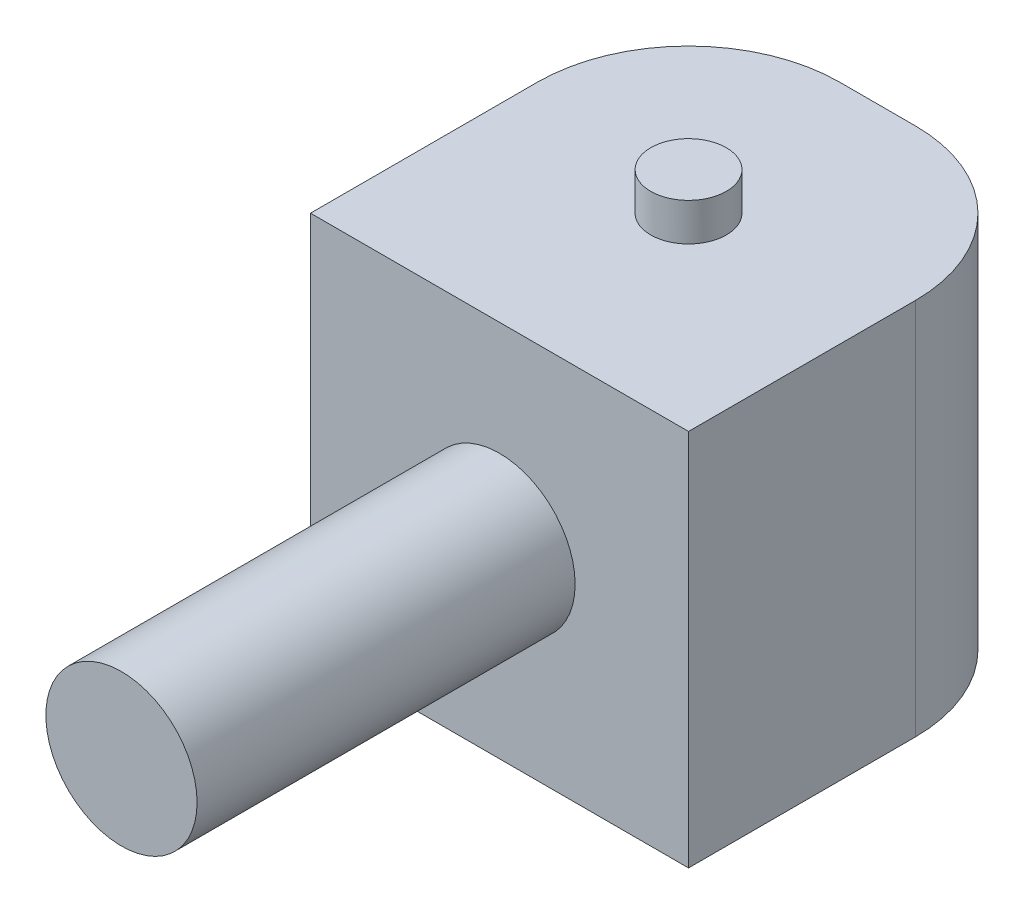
ISO-10303-21;
HEADER;
FILE_DESCRIPTION(('STEP AP214'),'2;1');
FILE_NAME('part.step','',(''),(''),'','','');
FILE_SCHEMA(('AUTOMOTIVE_DESIGN { 1 0 10303 214 1 1 1 1 }'));
ENDSEC;
DATA;
#1=APPLICATION_CONTEXT('core data for automotive mechanical design processes');
#2=APPLICATION_PROTOCOL_DEFINITION('international standard','automotive_design',2000,#1);
#3=PRODUCT_CONTEXT('',#1,'mechanical');
#4=PRODUCT('Part','Part','',(#3));
#5=PRODUCT_RELATED_PRODUCT_CATEGORY('part','',(#4));
#6=PRODUCT_DEFINITION_FORMATION('','',#4);
#7=PRODUCT_DEFINITION_CONTEXT('part definition',#1,'design');
#8=PRODUCT_DEFINITION('design','',#6,#7);
#9=PRODUCT_DEFINITION_SHAPE('','',#8);
#10=(LENGTH_UNIT() NAMED_UNIT(*) SI_UNIT(.MILLI.,.METRE.));
#11=(NAMED_UNIT(*) PLANE_ANGLE_UNIT() SI_UNIT($,.RADIAN.));
#12=(NAMED_UNIT(*) SI_UNIT($,.STERADIAN.) SOLID_ANGLE_UNIT());
#13=UNCERTAINTY_MEASURE_WITH_UNIT(LENGTH_MEASURE(1.E-05),#10,'distance_accuracy_value','');
#14=(GEOMETRIC_REPRESENTATION_CONTEXT(3) GLOBAL_UNCERTAINTY_ASSIGNED_CONTEXT((#13)) GLOBAL_UNIT_ASSIGNED_CONTEXT((#10,
#11,#12)) REPRESENTATION_CONTEXT('',''));
#15=CARTESIAN_POINT('',(0.,0.,0.));
#16=DIRECTION('',(0.,0.,1.));
#17=DIRECTION('',(1.,0.,0.));
#18=AXIS2_PLACEMENT_3D('',#15,#16,#17);
#19=CARTESIAN_POINT('',(1.27,-1.27,-2.54));
#20=DIRECTION('',(0.,-1.,0.));
#21=DIRECTION('',(0.,0.,-1.));
#22=AXIS2_PLACEMENT_3D('',#19,#20,#21);
#23=PLANE('',#22);
#24=DIRECTION('',(1.,0.,0.));
#25=VECTOR('',#24,1.);
#26=CARTESIAN_POINT('',(1.27,-1.27,-2.54));
#27=LINE('',#26,#25);
#28=CARTESIAN_POINT('',(-0.254,-1.27,-2.54));
#29=VERTEX_POINT('',#28);
#30=CARTESIAN_POINT('',(0.254,-1.27,-2.54));
#31=VERTEX_POINT('',#30);
#32=EDGE_CURVE('E100',#29,#31,#27,.T.);
#33=ORIENTED_EDGE('',*,*,#32,.T.);
#34=CARTESIAN_POINT('',(0.254,-1.27,-1.524));
#35=DIRECTION('',(0.,-1.,0.));
#36=DIRECTION('',(0.,0.,-1.));
#37=AXIS2_PLACEMENT_3D('',#34,#35,#36);
#38=CIRCLE('',#37,1.016);
#39=CARTESIAN_POINT('',(1.27,-1.27,-1.524));
#40=VERTEX_POINT('',#39);
#41=EDGE_CURVE('E41',#31,#40,#38,.T.);
#42=ORIENTED_EDGE('',*,*,#41,.T.);
#43=DIRECTION('',(0.,0.,1.));
#44=VECTOR('',#43,1.);
#45=CARTESIAN_POINT('',(1.27,-1.27,-2.54));
#46=LINE('',#45,#44);
#47=CARTESIAN_POINT('',(1.27,-1.27,0.));
#48=VERTEX_POINT('',#47);
#49=EDGE_CURVE('E126',#40,#48,#46,.T.);
#50=ORIENTED_EDGE('',*,*,#49,.T.);
#51=DIRECTION('',(1.,0.,0.));
#52=VECTOR('',#51,1.);
#53=CARTESIAN_POINT('',(1.27,-1.27,0.));
#54=LINE('',#53,#52);
#55=CARTESIAN_POINT('',(-1.27,-1.27,0.));
#56=VERTEX_POINT('',#55);
#57=EDGE_CURVE('E114',#56,#48,#54,.T.);
#58=ORIENTED_EDGE('',*,*,#57,.F.);
#59=DIRECTION('',(0.,0.,1.));
#60=VECTOR('',#59,1.);
#61=CARTESIAN_POINT('',(-1.27,-1.27,-2.54));
#62=LINE('',#61,#60);
#63=CARTESIAN_POINT('',(-1.27,-1.27,-1.524));
#64=VERTEX_POINT('',#63);
#65=EDGE_CURVE('E129',#64,#56,#62,.T.);
#66=ORIENTED_EDGE('',*,*,#65,.F.);
#67=CARTESIAN_POINT('',(-0.254,-1.27,-1.524));
#68=DIRECTION('',(0.,-1.,0.));
#69=DIRECTION('',(0.,0.,-1.));
#70=AXIS2_PLACEMENT_3D('',#67,#68,#69);
#71=CIRCLE('',#70,1.016);
#72=EDGE_CURVE('E48',#64,#29,#71,.T.);
#73=ORIENTED_EDGE('',*,*,#72,.T.);
#74=EDGE_LOOP('',(#33,#42,#50,#58,#66,#73));
#75=FACE_BOUND('',#74,.T.);
#76=CARTESIAN_POINT('',(0.,-1.27,-1.27));
#77=DIRECTION('',(0.,-1.,0.));
#78=DIRECTION('',(0.,0.,-1.));
#79=AXIS2_PLACEMENT_3D('',#76,#77,#78);
#80=CIRCLE('',#79,0.254);
#81=CARTESIAN_POINT('',(0.,-1.27,-1.524));
#82=VERTEX_POINT('',#81);
#83=EDGE_CURVE('E154',#82,#82,#80,.T.);
#84=ORIENTED_EDGE('',*,*,#83,.F.);
#85=EDGE_LOOP('',(#84));
#86=FACE_BOUND('',#85,.T.);
#87=ADVANCED_FACE('F33',(#75,#86),#23,.T.);
#88=CARTESIAN_POINT('',(0.,0.,0.));
#89=DIRECTION('',(0.,0.,1.));
#90=DIRECTION('',(1.,0.,0.));
#91=AXIS2_PLACEMENT_3D('',#88,#89,#90);
#92=PLANE('',#91);
#93=DIRECTION('',(0.,1.,0.));
#94=VECTOR('',#93,1.);
#95=CARTESIAN_POINT('',(1.27,-1.27,0.));
#96=LINE('',#95,#94);
#97=CARTESIAN_POINT('',(1.27,1.27,0.));
#98=VERTEX_POINT('',#97);
#99=EDGE_CURVE('E94',#48,#98,#96,.T.);
#100=ORIENTED_EDGE('',*,*,#99,.T.);
#101=DIRECTION('',(-1.,0.,0.));
#102=VECTOR('',#101,1.);
#103=CARTESIAN_POINT('',(1.27,1.27,0.));
#104=LINE('',#103,#102);
#105=CARTESIAN_POINT('',(-1.27,1.27,0.));
#106=VERTEX_POINT('',#105);
#107=EDGE_CURVE('E103',#98,#106,#104,.T.);
#108=ORIENTED_EDGE('',*,*,#107,.T.);
#109=DIRECTION('',(0.,-1.,0.));
#110=VECTOR('',#109,1.);
#111=CARTESIAN_POINT('',(-1.27,-1.27,0.));
#112=LINE('',#111,#110);
#113=EDGE_CURVE('E109',#106,#56,#112,.T.);
#114=ORIENTED_EDGE('',*,*,#113,.T.);
#115=ORIENTED_EDGE('',*,*,#57,.T.);
#116=EDGE_LOOP('',(#100,#108,#114,#115));
#117=FACE_BOUND('',#116,.T.);
#118=CARTESIAN_POINT('',(0.,0.,0.));
#119=DIRECTION('',(0.,0.,1.));
#120=DIRECTION('',(1.,0.,0.));
#121=AXIS2_PLACEMENT_3D('',#118,#119,#120);
#122=CIRCLE('',#121,0.508);
#123=CARTESIAN_POINT('',(0.508,0.,0.));
#124=VERTEX_POINT('',#123);
#125=EDGE_CURVE('E118',#124,#124,#122,.T.);
#126=ORIENTED_EDGE('',*,*,#125,.F.);
#127=EDGE_LOOP('',(#126));
#128=FACE_BOUND('',#127,.T.);
#129=ADVANCED_FACE('F111',(#117,#128),#92,.T.);
#130=CARTESIAN_POINT('',(1.27,-1.27,-2.54));
#131=DIRECTION('',(1.,0.,0.));
#132=DIRECTION('',(0.,0.,-1.));
#133=AXIS2_PLACEMENT_3D('',#130,#131,#132);
#134=PLANE('',#133);
#135=ORIENTED_EDGE('',*,*,#49,.F.);
#136=DIRECTION('',(0.,1.,0.));
#137=VECTOR('',#136,1.);
#138=CARTESIAN_POINT('',(1.27,1.27,-1.524));
#139=LINE('',#138,#137);
#140=CARTESIAN_POINT('',(1.27,1.27,-1.524));
#141=VERTEX_POINT('',#140);
#142=EDGE_CURVE('E97',#40,#141,#139,.T.);
#143=ORIENTED_EDGE('',*,*,#142,.T.);
#144=DIRECTION('',(0.,0.,1.));
#145=VECTOR('',#144,1.);
#146=CARTESIAN_POINT('',(1.27,1.27,-2.54));
#147=LINE('',#146,#145);
#148=EDGE_CURVE('E89',#141,#98,#147,.T.);
#149=ORIENTED_EDGE('',*,*,#148,.T.);
#150=ORIENTED_EDGE('',*,*,#99,.F.);
#151=EDGE_LOOP('',(#135,#143,#149,#150));
#152=FACE_BOUND('',#151,.T.);
#153=ADVANCED_FACE('F92',(#152),#134,.T.);
#154=CARTESIAN_POINT('',(-1.27,-1.27,-2.54));
#155=DIRECTION('',(-1.,0.,0.));
#156=DIRECTION('',(0.,0.,1.));
#157=AXIS2_PLACEMENT_3D('',#154,#155,#156);
#158=PLANE('',#157);
#159=DIRECTION('',(0.,0.,1.));
#160=VECTOR('',#159,1.);
#161=CARTESIAN_POINT('',(-1.27,1.27,-2.54));
#162=LINE('',#161,#160);
#163=CARTESIAN_POINT('',(-1.27,1.27,-1.524));
#164=VERTEX_POINT('',#163);
#165=EDGE_CURVE('E99',#164,#106,#162,.T.);
#166=ORIENTED_EDGE('',*,*,#165,.F.);
#167=DIRECTION('',(0.,-1.,0.));
#168=VECTOR('',#167,1.);
#169=CARTESIAN_POINT('',(-1.27,-1.27,-1.524));
#170=LINE('',#169,#168);
#171=EDGE_CURVE('E11',#164,#64,#170,.T.);
#172=ORIENTED_EDGE('',*,*,#171,.T.);
#173=ORIENTED_EDGE('',*,*,#65,.T.);
#174=ORIENTED_EDGE('',*,*,#113,.F.);
#175=EDGE_LOOP('',(#166,#172,#173,#174));
#176=FACE_BOUND('',#175,.T.);
#177=ADVANCED_FACE('F187',(#176),#158,.T.);
#178=CARTESIAN_POINT('',(1.27,1.27,-2.54));
#179=DIRECTION('',(0.,1.,0.));
#180=DIRECTION('',(0.,0.,1.));
#181=AXIS2_PLACEMENT_3D('',#178,#179,#180);
#182=PLANE('',#181);
#183=CARTESIAN_POINT('',(0.,1.27,-1.27));
#184=DIRECTION('',(0.,1.,0.));
#185=DIRECTION('',(0.,0.,1.));
#186=AXIS2_PLACEMENT_3D('',#183,#184,#185);
#187=CIRCLE('',#186,0.254);
#188=CARTESIAN_POINT('',(0.,1.27,-1.016));
#189=VERTEX_POINT('',#188);
#190=EDGE_CURVE('E128',#189,#189,#187,.T.);
#191=ORIENTED_EDGE('',*,*,#190,.F.);
#192=EDGE_LOOP('',(#191));
#193=FACE_BOUND('',#192,.T.);
#194=ORIENTED_EDGE('',*,*,#148,.F.);
#195=CARTESIAN_POINT('',(0.254,1.27,-1.524));
#196=DIRECTION('',(0.,1.,0.));
#197=DIRECTION('',(0.,0.,1.));
#198=AXIS2_PLACEMENT_3D('',#195,#196,#197);
#199=CIRCLE('',#198,1.016);
#200=CARTESIAN_POINT('',(0.254,1.27,-2.54));
#201=VERTEX_POINT('',#200);
#202=EDGE_CURVE('E137',#141,#201,#199,.T.);
#203=ORIENTED_EDGE('',*,*,#202,.T.);
#204=DIRECTION('',(-1.,0.,0.));
#205=VECTOR('',#204,1.);
#206=CARTESIAN_POINT('',(1.27,1.27,-2.54));
#207=LINE('',#206,#205);
#208=CARTESIAN_POINT('',(-0.254,1.27,-2.54));
#209=VERTEX_POINT('',#208);
#210=EDGE_CURVE('E125',#201,#209,#207,.T.);
#211=ORIENTED_EDGE('',*,*,#210,.T.);
#212=CARTESIAN_POINT('',(-0.254,1.27,-1.524));
#213=DIRECTION('',(0.,1.,0.));
#214=DIRECTION('',(0.,0.,1.));
#215=AXIS2_PLACEMENT_3D('',#212,#213,#214);
#216=CIRCLE('',#215,1.016);
#217=EDGE_CURVE('E135',#209,#164,#216,.T.);
#218=ORIENTED_EDGE('',*,*,#217,.T.);
#219=ORIENTED_EDGE('',*,*,#165,.T.);
#220=ORIENTED_EDGE('',*,*,#107,.F.);
#221=EDGE_LOOP('',(#194,#203,#211,#218,#219,#220));
#222=FACE_BOUND('',#221,.T.);
#223=ADVANCED_FACE('F104',(#193,#222),#182,.T.);
#224=CARTESIAN_POINT('',(0.,0.,-2.54));
#225=DIRECTION('',(0.,0.,1.));
#226=DIRECTION('',(1.,0.,0.));
#227=AXIS2_PLACEMENT_3D('',#224,#225,#226);
#228=PLANE('',#227);
#229=CARTESIAN_POINT('',(0.,0.,-2.54));
#230=DIRECTION('',(0.,0.,1.));
#231=DIRECTION('',(1.,0.,0.));
#232=AXIS2_PLACEMENT_3D('',#229,#230,#231);
#233=CIRCLE('',#232,0.1778);
#234=CARTESIAN_POINT('',(0.1778,0.,-2.54));
#235=VERTEX_POINT('',#234);
#236=EDGE_CURVE('E162',#235,#235,#233,.T.);
#237=ORIENTED_EDGE('',*,*,#236,.T.);
#238=EDGE_LOOP('',(#237));
#239=FACE_BOUND('',#238,.T.);
#240=ORIENTED_EDGE('',*,*,#210,.F.);
#241=DIRECTION('',(0.,1.,0.));
#242=VECTOR('',#241,1.);
#243=CARTESIAN_POINT('',(0.254,-1.27,-2.54));
#244=LINE('',#243,#242);
#245=EDGE_CURVE('E55',#201,#31,#244,.F.);
#246=ORIENTED_EDGE('',*,*,#245,.T.);
#247=ORIENTED_EDGE('',*,*,#32,.F.);
#248=DIRECTION('',(0.,-1.,0.));
#249=VECTOR('',#248,1.);
#250=CARTESIAN_POINT('',(-0.254,1.27,-2.54));
#251=LINE('',#250,#249);
#252=EDGE_CURVE('E139',#29,#209,#251,.F.);
#253=ORIENTED_EDGE('',*,*,#252,.T.);
#254=EDGE_LOOP('',(#240,#246,#247,#253));
#255=FACE_BOUND('',#254,.T.);
#256=ADVANCED_FACE('F149',(#239,#255),#228,.F.);
#257=CARTESIAN_POINT('',(0.,0.,2.54));
#258=DIRECTION('',(0.,0.,-1.));
#259=DIRECTION('',(-1.,0.,0.));
#260=AXIS2_PLACEMENT_3D('',#257,#258,#259);
#261=CYLINDRICAL_SURFACE('',#260,0.508);
#262=CARTESIAN_POINT('',(0.,0.,2.54));
#263=DIRECTION('',(0.,0.,1.));
#264=DIRECTION('',(1.,0.,0.));
#265=AXIS2_PLACEMENT_3D('',#262,#263,#264);
#266=CIRCLE('',#265,0.508);
#267=CARTESIAN_POINT('',(0.508,0.,2.54));
#268=VERTEX_POINT('',#267);
#269=EDGE_CURVE('E115',#268,#268,#266,.T.);
#270=ORIENTED_EDGE('',*,*,#269,.F.);
#271=EDGE_LOOP('',(#270));
#272=FACE_BOUND('',#271,.T.);
#273=ORIENTED_EDGE('',*,*,#125,.T.);
#274=EDGE_LOOP('',(#273));
#275=FACE_BOUND('',#274,.T.);
#276=ADVANCED_FACE('F210',(#272,#275),#261,.T.);
#277=CARTESIAN_POINT('',(0.,0.,2.54));
#278=DIRECTION('',(0.,0.,1.));
#279=DIRECTION('',(1.,0.,0.));
#280=AXIS2_PLACEMENT_3D('',#277,#278,#279);
#281=PLANE('',#280);
#282=ORIENTED_EDGE('',*,*,#269,.T.);
#283=EDGE_LOOP('',(#282));
#284=FACE_BOUND('',#283,.T.);
#285=ADVANCED_FACE('F259',(#284),#281,.T.);
#286=CARTESIAN_POINT('',(0.,-1.524,-1.27));
#287=DIRECTION('',(0.,1.,0.));
#288=DIRECTION('',(0.,0.,1.));
#289=AXIS2_PLACEMENT_3D('',#286,#287,#288);
#290=CYLINDRICAL_SURFACE('',#289,0.254);
#291=CARTESIAN_POINT('',(0.,-1.524,-1.27));
#292=DIRECTION('',(0.,-1.,0.));
#293=DIRECTION('',(0.,0.,-1.));
#294=AXIS2_PLACEMENT_3D('',#291,#292,#293);
#295=CIRCLE('',#294,0.254);
#296=CARTESIAN_POINT('',(0.,-1.524,-1.524));
#297=VERTEX_POINT('',#296);
#298=EDGE_CURVE('E152',#297,#297,#295,.T.);
#299=ORIENTED_EDGE('',*,*,#298,.F.);
#300=EDGE_LOOP('',(#299));
#301=FACE_BOUND('',#300,.T.);
#302=ORIENTED_EDGE('',*,*,#83,.T.);
#303=EDGE_LOOP('',(#302));
#304=FACE_BOUND('',#303,.T.);
#305=ADVANCED_FACE('F251',(#301,#304),#290,.T.);
#306=CARTESIAN_POINT('',(0.,-1.524,-1.27));
#307=DIRECTION('',(0.,-1.,0.));
#308=DIRECTION('',(0.,0.,-1.));
#309=AXIS2_PLACEMENT_3D('',#306,#307,#308);
#310=PLANE('',#309);
#311=ORIENTED_EDGE('',*,*,#298,.T.);
#312=EDGE_LOOP('',(#311));
#313=FACE_BOUND('',#312,.T.);
#314=ADVANCED_FACE('F242',(#313),#310,.T.);
#315=CARTESIAN_POINT('',(0.,1.524,-1.27));
#316=DIRECTION('',(0.,-1.,0.));
#317=DIRECTION('',(0.,0.,-1.));
#318=AXIS2_PLACEMENT_3D('',#315,#316,#317);
#319=CYLINDRICAL_SURFACE('',#318,0.254);
#320=CARTESIAN_POINT('',(0.,1.524,-1.27));
#321=DIRECTION('',(0.,-1.,0.));
#322=DIRECTION('',(0.,0.,-1.));
#323=AXIS2_PLACEMENT_3D('',#320,#321,#322);
#324=CIRCLE('',#323,0.254);
#325=CARTESIAN_POINT('',(0.,1.524,-1.524));
#326=VERTEX_POINT('',#325);
#327=EDGE_CURVE('E157',#326,#326,#324,.T.);
#328=ORIENTED_EDGE('',*,*,#327,.T.);
#329=EDGE_LOOP('',(#328));
#330=FACE_BOUND('',#329,.T.);
#331=ORIENTED_EDGE('',*,*,#190,.T.);
#332=EDGE_LOOP('',(#331));
#333=FACE_BOUND('',#332,.T.);
#334=ADVANCED_FACE('F175',(#330,#333),#319,.T.);
#335=CARTESIAN_POINT('',(0.,1.524,-1.27));
#336=DIRECTION('',(0.,1.,0.));
#337=DIRECTION('',(0.,0.,-1.));
#338=AXIS2_PLACEMENT_3D('',#335,#336,#337);
#339=PLANE('',#338);
#340=ORIENTED_EDGE('',*,*,#327,.F.);
#341=EDGE_LOOP('',(#340));
#342=FACE_BOUND('',#341,.T.);
#343=ADVANCED_FACE('F169',(#342),#339,.T.);
#344=CARTESIAN_POINT('',(0.,0.,-2.54));
#345=DIRECTION('',(0.,0.,1.));
#346=DIRECTION('',(1.,0.,0.));
#347=AXIS2_PLACEMENT_3D('',#344,#345,#346);
#348=SPHERICAL_SURFACE('',#347,0.1778);
#349=ORIENTED_EDGE('',*,*,#236,.F.);
#350=EDGE_LOOP('',(#349));
#351=FACE_BOUND('',#350,.T.);
#352=ADVANCED_FACE('F167',(#351),#348,.T.);
#353=CARTESIAN_POINT('',(0.254,-1.27,-1.524));
#354=DIRECTION('',(0.,-1.,0.));
#355=DIRECTION('',(0.,0.,-1.));
#356=AXIS2_PLACEMENT_3D('',#353,#354,#355);
#357=CYLINDRICAL_SURFACE('',#356,1.016);
#358=ORIENTED_EDGE('',*,*,#41,.F.);
#359=ORIENTED_EDGE('',*,*,#245,.F.);
#360=ORIENTED_EDGE('',*,*,#202,.F.);
#361=ORIENTED_EDGE('',*,*,#142,.F.);
#362=EDGE_LOOP('',(#358,#359,#360,#361));
#363=FACE_BOUND('',#362,.T.);
#364=ADVANCED_FACE('F146',(#363),#357,.T.);
#365=CARTESIAN_POINT('',(-0.254,-1.27,-1.524));
#366=DIRECTION('',(0.,1.,0.));
#367=DIRECTION('',(0.,0.,1.));
#368=AXIS2_PLACEMENT_3D('',#365,#366,#367);
#369=CYLINDRICAL_SURFACE('',#368,1.016);
#370=ORIENTED_EDGE('',*,*,#217,.F.);
#371=ORIENTED_EDGE('',*,*,#252,.F.);
#372=ORIENTED_EDGE('',*,*,#72,.F.);
#373=ORIENTED_EDGE('',*,*,#171,.F.);
#374=EDGE_LOOP('',(#370,#371,#372,#373));
#375=FACE_BOUND('',#374,.T.);
#376=ADVANCED_FACE('F35',(#375),#369,.T.);
#377=CLOSED_SHELL('',(#87,#129,#153,#177,#223,#256,#276,#285,#305,#314,#334,#343,#352,#364,#376));
#378=MANIFOLD_SOLID_BREP('B2',#377);
#379=ADVANCED_BREP_SHAPE_REPRESENTATION('',(#18,#378),#14);
#380=SHAPE_DEFINITION_REPRESENTATION(#9,#379);
ENDSEC;
END-ISO-10303-21;
